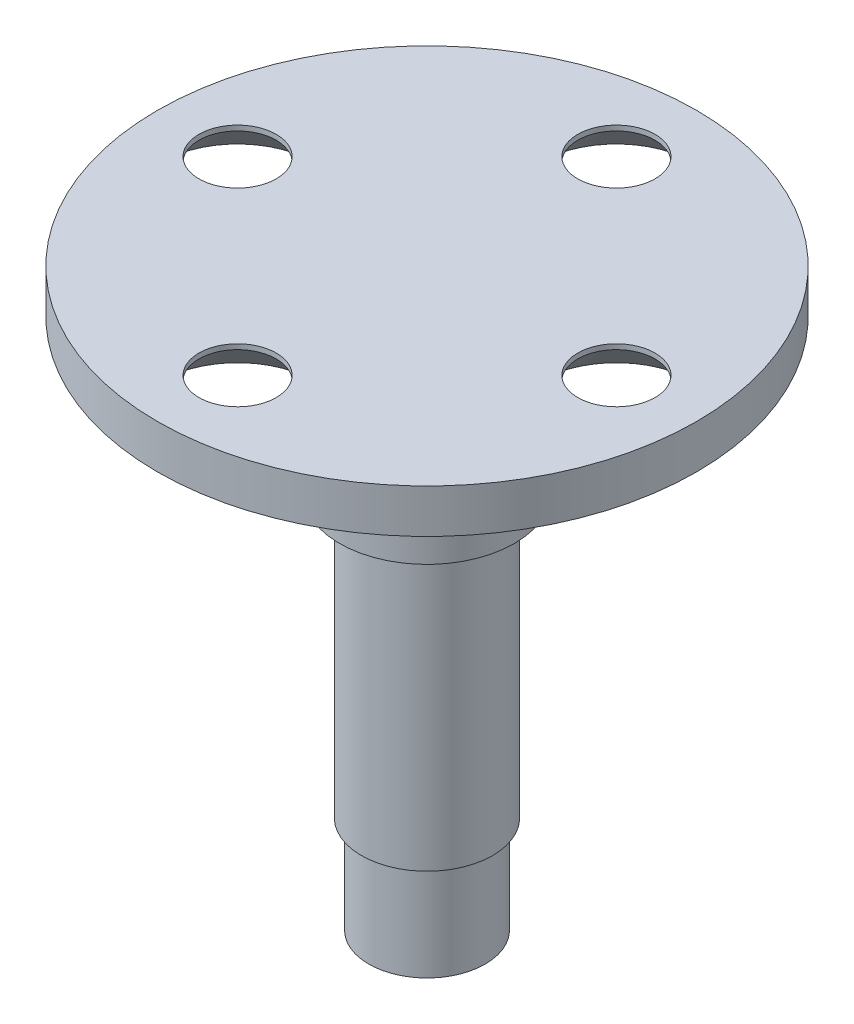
from build123d import *

# Parameters (mm, degrees)
TROU_TARAUD_M5X0_81_D                    = 4.2
TROU_TARAUD_M5X0_81_DEPTH                = 8
TROU_TARAUD_M5X0_81_CSINK_D              = 5
TROU_TARAUD_M5X0_81_CSINK_ANGLE          = 90
TROU_TARAUD_M5X0_81_TIP                  = 1.212435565
ENL_V_START                              = -0.5
ESQUISSE8_R                              = 19
ESQUISSE8_R_2                            = 7.5
ENL_V_MAT_EXTRU_1_DEPTH                  = 0.5
ENL_V_MAT_EXTRU_8_DEPTH                  = 25
FRAISAGE_POUR_VIS_T_TE_FRAIS_E_6_2_COUNT = 2
FRAISAGE_POUR_VIS_T_TE_FRAIS_E_6_2_PITCH = 18.384776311
FRAISAGE_POUR_VIS_T_TE_FRAIS_E_6_3_COUNT = 2
FRAISAGE_POUR_VIS_T_TE_FRAIS_E_6_3_PITCH = 26
FRAISAGE_POUR_VIS_T_TE_FRAIS_E_6_4_COUNT = 2
FRAISAGE_POUR_VIS_T_TE_FRAIS_E_6_4_PITCH = 18.384776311
ENL_V_MAT_EXTRU_10_DEPTH                 = 1.8


with BuildPart() as part:
    # Esquisse1 → R_volution1 (revolve)
    with BuildSketch(Plane.XY):
        Polygon((6, 0), (19, 0), (19, 25), (0, 25), (0, -36), (4, -36), (4, -29.3), (4.5, -29.3), (4.5, -10), (6, -10), align=None)
    revolve(axis=Axis((0, -36, 0), (0, 1, 0)))

    # Esquisse5 → Enl_vement de mati_re-R_volution1 (revolve, cut)
    with BuildSketch(Plane.XY, mode=Mode.PRIVATE) as enl_vement_de_mati_re_r_volution1_sk:
        Polygon((54.073263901, 30.0180301), (52.80505058, 34.751066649), (-34.128273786, 11.45735259), (-32.860060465, 6.724316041), align=None)
    revolve(enl_vement_de_mati_re_r_volution1_sk.sketch.rotate(Axis((-43.839989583, 3.782252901, 0), (0.9659258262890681, 0.25881904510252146, 0)), 180), axis=Axis((-43.839989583, 3.782252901, 0), (0.9659258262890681, 0.25881904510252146, 0)), mode=Mode.SUBTRACT)

    # Trou taraud_ M5x0.81
    with Locations(Plane.XZ.offset(36)):
        with Locations((0, 0)):
            CounterSinkHole(TROU_TARAUD_M5X0_81_D / 2, TROU_TARAUD_M5X0_81_CSINK_D / 2, depth=TROU_TARAUD_M5X0_81_DEPTH, counter_sink_angle=TROU_TARAUD_M5X0_81_CSINK_ANGLE)
            with Locations((0, 0, -(TROU_TARAUD_M5X0_81_DEPTH + TROU_TARAUD_M5X0_81_TIP / 2))):  # 120° drill point
                Cone(0, TROU_TARAUD_M5X0_81_D / 2, TROU_TARAUD_M5X0_81_TIP, mode=Mode.SUBTRACT)

    # Esquisse8 → Enl_v. mat.-Extru.1 (cut)
    with BuildSketch(Plane.XZ.offset(ENL_V_START)):
        Circle(ESQUISSE8_R)
        with Locations(Location((0, 0, 0), (0, 0, 270))):
            Circle(ESQUISSE8_R_2, mode=Mode.SUBTRACT)
    extrude(amount=ENL_V_MAT_EXTRU_1_DEPTH, mode=Mode.SUBTRACT)

    # Esquisse18 → Enl_v. mat.-Extru.8 (cut, symmetric)
    with BuildSketch(Plane.XY):
        Polygon((-19, 10.43810805), (19, 20.620177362), (19, 25), (-19, 25), align=None)
    extrude(amount=ENL_V_MAT_EXTRU_8_DEPTH, both=True, mode=Mode.SUBTRACT)

    # Esquisse22 → Enl_vement de mati_re-R_volution2 (revolve, cut)
    with BuildSketch(Plane.XY, mode=Mode.PRIVATE) as enl_vement_de_mati_re_r_volution2_sk:
        Polygon((0, 3.5), (15.5, 3.5), (18.5, 3.5), (18.5, 0.5), (19, 0), (19, 21.817874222), (0, 21.817874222), align=None)
    revolve(enl_vement_de_mati_re_r_volution2_sk.sketch.rotate(Axis((0, 18.435875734, 0), (0, 1, 0)), 90), axis=Axis((0, 18.435875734, 0), (0, 1, 0)), mode=Mode.SUBTRACT)

    # Esquisse23 → Fraisage pour vis _ t_te frais_e _ 6 pan (revolve, cut)
    with BuildSketch(Plane(origin=(0, 0.5, 13), x_dir=(0, 0, -1), z_dir=(1, 0, 0))):
        Polygon((0, 0), (0, 3), (2.65, 3), (2.65, 2.65), (5.3, 0), align=None)
    fraisage_pour_vis_t_te_frais_e_6_pan = revolve(axis=Axis((0, -5.85, 13), (0, 1, 0)), mode=Mode.SUBTRACT)

    # Fraisage pour vis _ t_te frais_e _ 6 2: Fraisage pour vis _ t_te frais_e _ 6 pan ×2
    with Locations(*[Vector(0.7071067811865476, 0, -0.7071067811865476) * (i * FRAISAGE_POUR_VIS_T_TE_FRAIS_E_6_2_PITCH) for i in range(1, FRAISAGE_POUR_VIS_T_TE_FRAIS_E_6_2_COUNT)]):
        add(fraisage_pour_vis_t_te_frais_e_6_pan, mode=Mode.SUBTRACT)

    # Fraisage pour vis _ t_te frais_e _ 6 3: Fraisage pour vis _ t_te frais_e _ 6 pan ×2
    with Locations(*[(0, 0, -i * FRAISAGE_POUR_VIS_T_TE_FRAIS_E_6_3_PITCH) for i in range(1, FRAISAGE_POUR_VIS_T_TE_FRAIS_E_6_3_COUNT)]):
        add(fraisage_pour_vis_t_te_frais_e_6_pan, mode=Mode.SUBTRACT)

    # Fraisage pour vis _ t_te frais_e _ 6 4: Fraisage pour vis _ t_te frais_e _ 6 pan ×2
    with Locations(*[Vector(-0.7071067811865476, 0, -0.7071067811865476) * (i * FRAISAGE_POUR_VIS_T_TE_FRAIS_E_6_4_PITCH) for i in range(1, FRAISAGE_POUR_VIS_T_TE_FRAIS_E_6_4_COUNT)]):
        add(fraisage_pour_vis_t_te_frais_e_6_pan, mode=Mode.SUBTRACT)

    # Esquisse25 → Enl_v. mat.-Extru.10 (cut)
    with BuildSketch(Plane(origin=(-4.5, 0, 0), x_dir=(0, 0, -1), z_dir=(1, 0, 0))):
        with BuildLine():
            Line((1.5, -12), (1.5, -22))
            ThreePointArc((1.5, -22), (0, -23.5), (-1.5, -22))
            Line((-1.5, -22), (-1.5, -12))
            ThreePointArc((-1.5, -12), (0, -10.5), (1.5, -12))
        make_face()
    extrude(amount=ENL_V_MAT_EXTRU_10_DEPTH, mode=Mode.SUBTRACT)


solid = part.part
